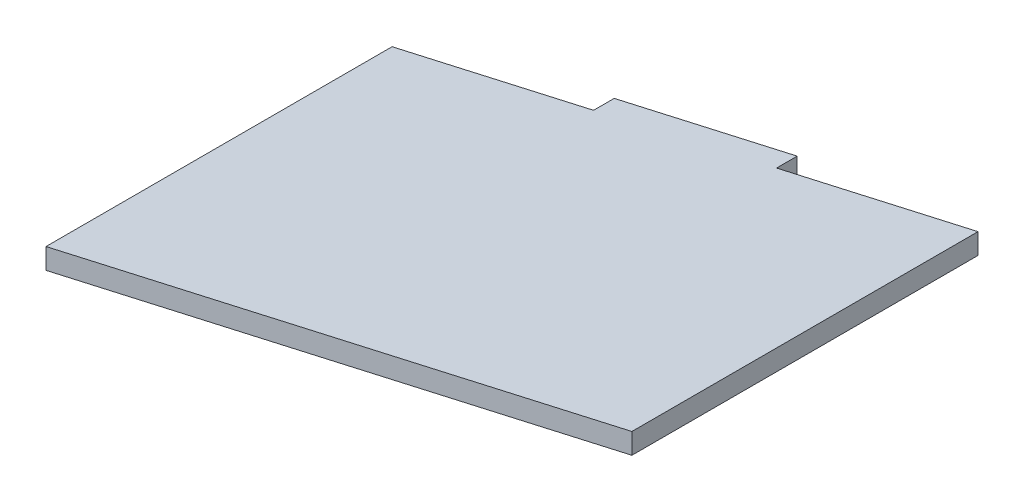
ISO-10303-21;
HEADER;
FILE_DESCRIPTION(('STEP AP214'),'2;1');
FILE_NAME('part.step','',(''),(''),'','','');
FILE_SCHEMA(('AUTOMOTIVE_DESIGN { 1 0 10303 214 1 1 1 1 }'));
ENDSEC;
DATA;
#1=APPLICATION_CONTEXT('core data for automotive mechanical design processes');
#2=APPLICATION_PROTOCOL_DEFINITION('international standard','automotive_design',2000,#1);
#3=PRODUCT_CONTEXT('',#1,'mechanical');
#4=PRODUCT('Part','Part','',(#3));
#5=PRODUCT_RELATED_PRODUCT_CATEGORY('part','',(#4));
#6=PRODUCT_DEFINITION_FORMATION('','',#4);
#7=PRODUCT_DEFINITION_CONTEXT('part definition',#1,'design');
#8=PRODUCT_DEFINITION('design','',#6,#7);
#9=PRODUCT_DEFINITION_SHAPE('','',#8);
#10=(LENGTH_UNIT() NAMED_UNIT(*) SI_UNIT(.MILLI.,.METRE.));
#11=(NAMED_UNIT(*) PLANE_ANGLE_UNIT() SI_UNIT($,.RADIAN.));
#12=(NAMED_UNIT(*) SI_UNIT($,.STERADIAN.) SOLID_ANGLE_UNIT());
#13=UNCERTAINTY_MEASURE_WITH_UNIT(LENGTH_MEASURE(1.E-05),#10,'distance_accuracy_value','');
#14=(GEOMETRIC_REPRESENTATION_CONTEXT(3) GLOBAL_UNCERTAINTY_ASSIGNED_CONTEXT((#13)) GLOBAL_UNIT_ASSIGNED_CONTEXT((#10,
#11,#12)) REPRESENTATION_CONTEXT('',''));
#15=CARTESIAN_POINT('',(0.,0.,0.));
#16=DIRECTION('',(0.,0.,1.));
#17=DIRECTION('',(1.,0.,0.));
#18=AXIS2_PLACEMENT_3D('',#15,#16,#17);
#19=CARTESIAN_POINT('',(-70.9047648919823,56.1331601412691,-41.8863061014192));
#20=DIRECTION('',(1.,0.,0.));
#21=DIRECTION('',(0.,0.,-1.));
#22=AXIS2_PLACEMENT_3D('',#19,#20,#21);
#23=PLANE('',#22);
#24=DIRECTION('',(0.,0.,1.));
#25=VECTOR('',#24,1.);
#26=CARTESIAN_POINT('',(-70.9047648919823,51.1331601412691,-41.8863061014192));
#27=LINE('',#26,#25);
#28=CARTESIAN_POINT('',(-70.9047648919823,51.1331601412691,-41.8863061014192));
#29=VERTEX_POINT('',#28);
#30=CARTESIAN_POINT('',(-70.9047648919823,51.1331601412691,41.8863061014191));
#31=VERTEX_POINT('',#30);
#32=EDGE_CURVE('E131',#29,#31,#27,.T.);
#33=ORIENTED_EDGE('',*,*,#32,.T.);
#34=DIRECTION('',(0.,-1.,0.));
#35=VECTOR('',#34,1.);
#36=CARTESIAN_POINT('',(-70.9047648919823,56.1331601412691,41.8863061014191));
#37=LINE('',#36,#35);
#38=CARTESIAN_POINT('',(-70.9047648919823,56.1331601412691,41.8863061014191));
#39=VERTEX_POINT('',#38);
#40=EDGE_CURVE('E11',#39,#31,#37,.T.);
#41=ORIENTED_EDGE('',*,*,#40,.F.);
#42=DIRECTION('',(0.,0.,1.));
#43=VECTOR('',#42,1.);
#44=CARTESIAN_POINT('',(-70.9047648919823,56.1331601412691,-41.8863061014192));
#45=LINE('',#44,#43);
#46=CARTESIAN_POINT('',(-70.9047648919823,56.1331601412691,-41.8863061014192));
#47=VERTEX_POINT('',#46);
#48=EDGE_CURVE('E145',#47,#39,#45,.T.);
#49=ORIENTED_EDGE('',*,*,#48,.F.);
#50=DIRECTION('',(0.,-1.,0.));
#51=VECTOR('',#50,1.);
#52=CARTESIAN_POINT('',(-70.9047648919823,56.1331601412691,-41.8863061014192));
#53=LINE('',#52,#51);
#54=EDGE_CURVE('E127',#47,#29,#53,.T.);
#55=ORIENTED_EDGE('',*,*,#54,.T.);
#56=EDGE_LOOP('',(#33,#41,#49,#55));
#57=FACE_BOUND('',#56,.T.);
#58=ADVANCED_FACE('F35',(#57),#23,.F.);
#59=CARTESIAN_POINT('',(70.9047648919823,88.2717415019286,41.8863061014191));
#60=DIRECTION('',(0.,0.,-1.));
#61=DIRECTION('',(0.,1.,0.));
#62=AXIS2_PLACEMENT_3D('',#59,#60,#61);
#63=PLANE('',#62);
#64=DIRECTION('',(0.975267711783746,0.221026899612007,0.));
#65=VECTOR('',#64,1.);
#66=CARTESIAN_POINT('',(70.9047648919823,83.2717415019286,41.8863061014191));
#67=LINE('',#66,#65);
#68=CARTESIAN_POINT('',(70.9047648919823,83.2717415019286,41.8863061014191));
#69=VERTEX_POINT('',#68);
#70=EDGE_CURVE('E134',#31,#69,#67,.T.);
#71=ORIENTED_EDGE('',*,*,#70,.T.);
#72=DIRECTION('',(0.,-1.,0.));
#73=VECTOR('',#72,1.);
#74=CARTESIAN_POINT('',(70.9047648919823,88.2717415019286,41.8863061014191));
#75=LINE('',#74,#73);
#76=CARTESIAN_POINT('',(70.9047648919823,88.2717415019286,41.8863061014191));
#77=VERTEX_POINT('',#76);
#78=EDGE_CURVE('E43',#77,#69,#75,.T.);
#79=ORIENTED_EDGE('',*,*,#78,.F.);
#80=DIRECTION('',(0.975267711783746,0.221026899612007,0.));
#81=VECTOR('',#80,1.);
#82=CARTESIAN_POINT('',(70.9047648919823,88.2717415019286,41.8863061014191));
#83=LINE('',#82,#81);
#84=EDGE_CURVE('E94',#39,#77,#83,.T.);
#85=ORIENTED_EDGE('',*,*,#84,.F.);
#86=ORIENTED_EDGE('',*,*,#40,.T.);
#87=EDGE_LOOP('',(#71,#79,#85,#86));
#88=FACE_BOUND('',#87,.T.);
#89=ADVANCED_FACE('F180',(#88),#63,.F.);
#90=CARTESIAN_POINT('',(70.9047648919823,88.2717415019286,-41.8863061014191));
#91=DIRECTION('',(-1.,0.,0.));
#92=DIRECTION('',(0.,0.,1.));
#93=AXIS2_PLACEMENT_3D('',#90,#91,#92);
#94=PLANE('',#93);
#95=DIRECTION('',(0.,0.,-1.));
#96=VECTOR('',#95,1.);
#97=CARTESIAN_POINT('',(70.9047648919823,83.2717415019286,-41.8863061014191));
#98=LINE('',#97,#96);
#99=CARTESIAN_POINT('',(70.9047648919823,83.2717415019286,-41.8863061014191));
#100=VERTEX_POINT('',#99);
#101=EDGE_CURVE('E136',#69,#100,#98,.T.);
#102=ORIENTED_EDGE('',*,*,#101,.T.);
#103=DIRECTION('',(0.,-1.,0.));
#104=VECTOR('',#103,1.);
#105=CARTESIAN_POINT('',(70.9047648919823,88.2717415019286,-41.8863061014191));
#106=LINE('',#105,#104);
#107=CARTESIAN_POINT('',(70.9047648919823,88.2717415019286,-41.8863061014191));
#108=VERTEX_POINT('',#107);
#109=EDGE_CURVE('E152',#108,#100,#106,.T.);
#110=ORIENTED_EDGE('',*,*,#109,.F.);
#111=DIRECTION('',(0.,0.,-1.));
#112=VECTOR('',#111,1.);
#113=CARTESIAN_POINT('',(70.9047648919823,88.2717415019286,-41.8863061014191));
#114=LINE('',#113,#112);
#115=EDGE_CURVE('E160',#77,#108,#114,.T.);
#116=ORIENTED_EDGE('',*,*,#115,.F.);
#117=ORIENTED_EDGE('',*,*,#78,.T.);
#118=EDGE_LOOP('',(#102,#110,#116,#117));
#119=FACE_BOUND('',#118,.T.);
#120=ADVANCED_FACE('F158',(#119),#94,.F.);
#121=CARTESIAN_POINT('',(22.1413793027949,77.2203965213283,-41.8863061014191));
#122=DIRECTION('',(0.,0.,1.));
#123=DIRECTION('',(1.,0.,0.));
#124=AXIS2_PLACEMENT_3D('',#121,#122,#123);
#125=PLANE('',#124);
#126=DIRECTION('',(-0.975267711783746,-0.221026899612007,0.));
#127=VECTOR('',#126,1.);
#128=CARTESIAN_POINT('',(22.1413793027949,72.2203965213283,-41.8863061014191));
#129=LINE('',#128,#127);
#130=CARTESIAN_POINT('',(22.1413793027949,72.2203965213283,-41.8863061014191));
#131=VERTEX_POINT('',#130);
#132=EDGE_CURVE('E138',#100,#131,#129,.T.);
#133=ORIENTED_EDGE('',*,*,#132,.T.);
#134=DIRECTION('',(0.,-1.,0.));
#135=VECTOR('',#134,1.);
#136=CARTESIAN_POINT('',(22.1413793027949,77.2203965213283,-41.8863061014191));
#137=LINE('',#136,#135);
#138=CARTESIAN_POINT('',(22.1413793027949,77.2203965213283,-41.8863061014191));
#139=VERTEX_POINT('',#138);
#140=EDGE_CURVE('E149',#139,#131,#137,.T.);
#141=ORIENTED_EDGE('',*,*,#140,.F.);
#142=DIRECTION('',(-0.975267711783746,-0.221026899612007,0.));
#143=VECTOR('',#142,1.);
#144=CARTESIAN_POINT('',(22.1413793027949,77.2203965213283,-41.8863061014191));
#145=LINE('',#144,#143);
#146=EDGE_CURVE('E172',#108,#139,#145,.T.);
#147=ORIENTED_EDGE('',*,*,#146,.F.);
#148=ORIENTED_EDGE('',*,*,#109,.T.);
#149=EDGE_LOOP('',(#133,#141,#147,#148));
#150=FACE_BOUND('',#149,.T.);
#151=ADVANCED_FACE('F168',(#150),#125,.F.);
#152=CARTESIAN_POINT('',(22.1413793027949,77.2203965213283,-46.8863061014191));
#153=DIRECTION('',(-1.,0.,0.));
#154=DIRECTION('',(0.,0.,1.));
#155=AXIS2_PLACEMENT_3D('',#152,#153,#154);
#156=PLANE('',#155);
#157=DIRECTION('',(0.,0.,-1.));
#158=VECTOR('',#157,1.);
#159=CARTESIAN_POINT('',(22.1413793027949,72.2203965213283,-46.8863061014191));
#160=LINE('',#159,#158);
#161=CARTESIAN_POINT('',(22.1413793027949,72.2203965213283,-46.8863061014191));
#162=VERTEX_POINT('',#161);
#163=EDGE_CURVE('E140',#131,#162,#160,.T.);
#164=ORIENTED_EDGE('',*,*,#163,.T.);
#165=DIRECTION('',(0.,-1.,0.));
#166=VECTOR('',#165,1.);
#167=CARTESIAN_POINT('',(22.1413793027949,77.2203965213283,-46.8863061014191));
#168=LINE('',#167,#166);
#169=CARTESIAN_POINT('',(22.1413793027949,77.2203965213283,-46.8863061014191));
#170=VERTEX_POINT('',#169);
#171=EDGE_CURVE('E122',#170,#162,#168,.T.);
#172=ORIENTED_EDGE('',*,*,#171,.F.);
#173=DIRECTION('',(0.,0.,-1.));
#174=VECTOR('',#173,1.);
#175=CARTESIAN_POINT('',(22.1413793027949,77.2203965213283,-46.8863061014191));
#176=LINE('',#175,#174);
#177=EDGE_CURVE('E113',#139,#170,#176,.T.);
#178=ORIENTED_EDGE('',*,*,#177,.F.);
#179=ORIENTED_EDGE('',*,*,#140,.T.);
#180=EDGE_LOOP('',(#164,#172,#178,#179));
#181=FACE_BOUND('',#180,.T.);
#182=ADVANCED_FACE('F171',(#181),#156,.F.);
#183=CARTESIAN_POINT('',(-22.141379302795,67.1845051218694,-46.8863061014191));
#184=DIRECTION('',(0.,0.,1.));
#185=DIRECTION('',(1.,0.,0.));
#186=AXIS2_PLACEMENT_3D('',#183,#184,#185);
#187=PLANE('',#186);
#188=DIRECTION('',(-0.975267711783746,-0.221026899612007,0.));
#189=VECTOR('',#188,1.);
#190=CARTESIAN_POINT('',(-22.141379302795,62.1845051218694,-46.8863061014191));
#191=LINE('',#190,#189);
#192=CARTESIAN_POINT('',(-22.141379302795,62.1845051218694,-46.8863061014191));
#193=VERTEX_POINT('',#192);
#194=EDGE_CURVE('E121',#162,#193,#191,.T.);
#195=ORIENTED_EDGE('',*,*,#194,.T.);
#196=DIRECTION('',(0.,-1.,0.));
#197=VECTOR('',#196,1.);
#198=CARTESIAN_POINT('',(-22.141379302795,67.1845051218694,-46.8863061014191));
#199=LINE('',#198,#197);
#200=CARTESIAN_POINT('',(-22.141379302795,67.1845051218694,-46.8863061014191));
#201=VERTEX_POINT('',#200);
#202=EDGE_CURVE('E118',#201,#193,#199,.T.);
#203=ORIENTED_EDGE('',*,*,#202,.F.);
#204=DIRECTION('',(-0.975267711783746,-0.221026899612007,0.));
#205=VECTOR('',#204,1.);
#206=CARTESIAN_POINT('',(-22.141379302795,67.1845051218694,-46.8863061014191));
#207=LINE('',#206,#205);
#208=EDGE_CURVE('E107',#170,#201,#207,.T.);
#209=ORIENTED_EDGE('',*,*,#208,.F.);
#210=ORIENTED_EDGE('',*,*,#171,.T.);
#211=EDGE_LOOP('',(#195,#203,#209,#210));
#212=FACE_BOUND('',#211,.T.);
#213=ADVANCED_FACE('F119',(#212),#187,.F.);
#214=CARTESIAN_POINT('',(-22.141379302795,67.1845051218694,-41.8863061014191));
#215=DIRECTION('',(1.,0.,0.));
#216=DIRECTION('',(0.,0.,-1.));
#217=AXIS2_PLACEMENT_3D('',#214,#215,#216);
#218=PLANE('',#217);
#219=DIRECTION('',(0.,0.,1.));
#220=VECTOR('',#219,1.);
#221=CARTESIAN_POINT('',(-22.141379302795,62.1845051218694,-41.8863061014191));
#222=LINE('',#221,#220);
#223=CARTESIAN_POINT('',(-22.141379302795,62.1845051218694,-41.8863061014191));
#224=VERTEX_POINT('',#223);
#225=EDGE_CURVE('E80',#193,#224,#222,.T.);
#226=ORIENTED_EDGE('',*,*,#225,.T.);
#227=DIRECTION('',(0.,-1.,0.));
#228=VECTOR('',#227,1.);
#229=CARTESIAN_POINT('',(-22.141379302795,67.1845051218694,-41.8863061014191));
#230=LINE('',#229,#228);
#231=CARTESIAN_POINT('',(-22.141379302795,67.1845051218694,-41.8863061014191));
#232=VERTEX_POINT('',#231);
#233=EDGE_CURVE('E123',#232,#224,#230,.T.);
#234=ORIENTED_EDGE('',*,*,#233,.F.);
#235=DIRECTION('',(0.,0.,1.));
#236=VECTOR('',#235,1.);
#237=CARTESIAN_POINT('',(-22.141379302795,67.1845051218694,-41.8863061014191));
#238=LINE('',#237,#236);
#239=EDGE_CURVE('E111',#201,#232,#238,.T.);
#240=ORIENTED_EDGE('',*,*,#239,.F.);
#241=ORIENTED_EDGE('',*,*,#202,.T.);
#242=EDGE_LOOP('',(#226,#234,#240,#241));
#243=FACE_BOUND('',#242,.T.);
#244=ADVANCED_FACE('F125',(#243),#218,.F.);
#245=CARTESIAN_POINT('',(-70.9047648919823,56.1331601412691,-41.8863061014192));
#246=DIRECTION('',(0.,0.,1.));
#247=DIRECTION('',(1.,0.,0.));
#248=AXIS2_PLACEMENT_3D('',#245,#246,#247);
#249=PLANE('',#248);
#250=DIRECTION('',(-0.975267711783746,-0.221026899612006,0.));
#251=VECTOR('',#250,1.);
#252=CARTESIAN_POINT('',(-70.9047648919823,51.1331601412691,-41.8863061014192));
#253=LINE('',#252,#251);
#254=EDGE_CURVE('E86',#224,#29,#253,.T.);
#255=ORIENTED_EDGE('',*,*,#254,.T.);
#256=ORIENTED_EDGE('',*,*,#54,.F.);
#257=DIRECTION('',(-0.975267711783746,-0.221026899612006,0.));
#258=VECTOR('',#257,1.);
#259=CARTESIAN_POINT('',(-70.9047648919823,56.1331601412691,-41.8863061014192));
#260=LINE('',#259,#258);
#261=EDGE_CURVE('E51',#232,#47,#260,.T.);
#262=ORIENTED_EDGE('',*,*,#261,.F.);
#263=ORIENTED_EDGE('',*,*,#233,.T.);
#264=EDGE_LOOP('',(#255,#256,#262,#263));
#265=FACE_BOUND('',#264,.T.);
#266=ADVANCED_FACE('F196',(#265),#249,.F.);
#267=CARTESIAN_POINT('',(-14.4861870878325,68.9194168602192,0.));
#268=DIRECTION('',(0.221026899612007,-0.975267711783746,0.));
#269=DIRECTION('',(0.975267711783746,0.221026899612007,0.));
#270=AXIS2_PLACEMENT_3D('',#267,#268,#269);
#271=PLANE('',#270);
#272=ORIENTED_EDGE('',*,*,#48,.T.);
#273=ORIENTED_EDGE('',*,*,#84,.T.);
#274=ORIENTED_EDGE('',*,*,#115,.T.);
#275=ORIENTED_EDGE('',*,*,#146,.T.);
#276=ORIENTED_EDGE('',*,*,#177,.T.);
#277=ORIENTED_EDGE('',*,*,#208,.T.);
#278=ORIENTED_EDGE('',*,*,#239,.T.);
#279=ORIENTED_EDGE('',*,*,#261,.T.);
#280=EDGE_LOOP('',(#272,#273,#274,#275,#276,#277,#278,#279));
#281=FACE_BOUND('',#280,.T.);
#282=ADVANCED_FACE('F109',(#281),#271,.F.);
#283=CARTESIAN_POINT('',(-14.4861870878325,63.9194168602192,0.));
#284=DIRECTION('',(0.221026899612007,-0.975267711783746,0.));
#285=DIRECTION('',(0.975267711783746,0.221026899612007,0.));
#286=AXIS2_PLACEMENT_3D('',#283,#284,#285);
#287=PLANE('',#286);
#288=ORIENTED_EDGE('',*,*,#32,.F.);
#289=ORIENTED_EDGE('',*,*,#254,.F.);
#290=ORIENTED_EDGE('',*,*,#225,.F.);
#291=ORIENTED_EDGE('',*,*,#194,.F.);
#292=ORIENTED_EDGE('',*,*,#163,.F.);
#293=ORIENTED_EDGE('',*,*,#132,.F.);
#294=ORIENTED_EDGE('',*,*,#101,.F.);
#295=ORIENTED_EDGE('',*,*,#70,.F.);
#296=EDGE_LOOP('',(#288,#289,#290,#291,#292,#293,#294,#295));
#297=FACE_BOUND('',#296,.T.);
#298=ADVANCED_FACE('F164',(#297),#287,.T.);
#299=CLOSED_SHELL('',(#58,#89,#120,#151,#182,#213,#244,#266,#282,#298));
#300=MANIFOLD_SOLID_BREP('B2',#299);
#301=ADVANCED_BREP_SHAPE_REPRESENTATION('',(#18,#300),#14);
#302=SHAPE_DEFINITION_REPRESENTATION(#9,#301);
ENDSEC;
END-ISO-10303-21;
